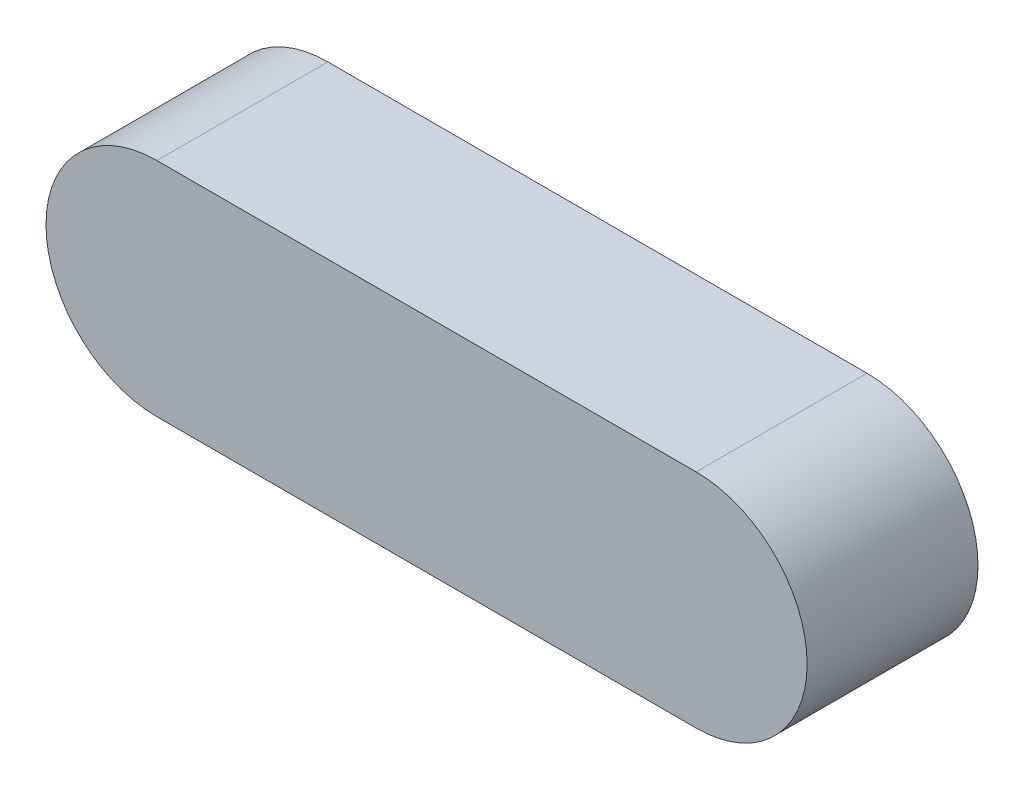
ISO-10303-21;
HEADER;
FILE_DESCRIPTION(('STEP AP214'),'2;1');
FILE_NAME('part.step','',(''),(''),'','','');
FILE_SCHEMA(('AUTOMOTIVE_DESIGN { 1 0 10303 214 1 1 1 1 }'));
ENDSEC;
DATA;
#1=APPLICATION_CONTEXT('core data for automotive mechanical design processes');
#2=APPLICATION_PROTOCOL_DEFINITION('international standard','automotive_design',2000,#1);
#3=PRODUCT_CONTEXT('',#1,'mechanical');
#4=PRODUCT('Part','Part','',(#3));
#5=PRODUCT_RELATED_PRODUCT_CATEGORY('part','',(#4));
#6=PRODUCT_DEFINITION_FORMATION('','',#4);
#7=PRODUCT_DEFINITION_CONTEXT('part definition',#1,'design');
#8=PRODUCT_DEFINITION('design','',#6,#7);
#9=PRODUCT_DEFINITION_SHAPE('','',#8);
#10=(LENGTH_UNIT() NAMED_UNIT(*) SI_UNIT(.MILLI.,.METRE.));
#11=(NAMED_UNIT(*) PLANE_ANGLE_UNIT() SI_UNIT($,.RADIAN.));
#12=(NAMED_UNIT(*) SI_UNIT($,.STERADIAN.) SOLID_ANGLE_UNIT());
#13=UNCERTAINTY_MEASURE_WITH_UNIT(LENGTH_MEASURE(1.E-05),#10,'distance_accuracy_value','');
#14=(GEOMETRIC_REPRESENTATION_CONTEXT(3) GLOBAL_UNCERTAINTY_ASSIGNED_CONTEXT((#13)) GLOBAL_UNIT_ASSIGNED_CONTEXT((#10,
#11,#12)) REPRESENTATION_CONTEXT('',''));
#15=CARTESIAN_POINT('',(0.,0.,0.));
#16=DIRECTION('',(0.,0.,1.));
#17=DIRECTION('',(1.,0.,0.));
#18=AXIS2_PLACEMENT_3D('',#15,#16,#17);
#19=CARTESIAN_POINT('',(-44.45,0.,0.));
#20=DIRECTION('',(0.,0.,1.));
#21=DIRECTION('',(1.,0.,0.));
#22=AXIS2_PLACEMENT_3D('',#19,#20,#21);
#23=PLANE('',#22);
#24=DIRECTION('',(1.,0.,0.));
#25=VECTOR('',#24,1.);
#26=CARTESIAN_POINT('',(0.,-18.288,0.));
#27=LINE('',#26,#25);
#28=CARTESIAN_POINT('',(-88.9,-18.288,0.));
#29=VERTEX_POINT('',#28);
#30=CARTESIAN_POINT('',(0.,-18.288,0.));
#31=VERTEX_POINT('',#30);
#32=EDGE_CURVE('E53',#29,#31,#27,.T.);
#33=ORIENTED_EDGE('',*,*,#32,.F.);
#34=CARTESIAN_POINT('',(-88.9,0.,0.));
#35=DIRECTION('',(0.,0.,1.));
#36=DIRECTION('',(1.,0.,0.));
#37=AXIS2_PLACEMENT_3D('',#34,#35,#36);
#38=CIRCLE('',#37,18.288);
#39=CARTESIAN_POINT('',(-88.9,18.288,0.));
#40=VERTEX_POINT('',#39);
#41=EDGE_CURVE('E68',#40,#29,#38,.T.);
#42=ORIENTED_EDGE('',*,*,#41,.F.);
#43=DIRECTION('',(1.,0.,0.));
#44=VECTOR('',#43,1.);
#45=CARTESIAN_POINT('',(-88.9,18.288,0.));
#46=LINE('',#45,#44);
#47=CARTESIAN_POINT('',(0.,18.288,0.));
#48=VERTEX_POINT('',#47);
#49=EDGE_CURVE('E66',#48,#40,#46,.F.);
#50=ORIENTED_EDGE('',*,*,#49,.F.);
#51=CARTESIAN_POINT('',(0.,0.,0.));
#52=DIRECTION('',(0.,0.,1.));
#53=DIRECTION('',(1.,0.,0.));
#54=AXIS2_PLACEMENT_3D('',#51,#52,#53);
#55=CIRCLE('',#54,18.288);
#56=EDGE_CURVE('E19',#31,#48,#55,.T.);
#57=ORIENTED_EDGE('',*,*,#56,.F.);
#58=EDGE_LOOP('',(#33,#42,#50,#57));
#59=FACE_BOUND('',#58,.T.);
#60=ADVANCED_FACE('F16',(#59),#23,.F.);
#61=CARTESIAN_POINT('',(0.,-18.288,0.));
#62=DIRECTION('',(0.,-1.,0.));
#63=DIRECTION('',(0.,0.,-1.));
#64=AXIS2_PLACEMENT_3D('',#61,#62,#63);
#65=PLANE('',#64);
#66=ORIENTED_EDGE('',*,*,#32,.T.);
#67=DIRECTION('',(0.,0.,1.));
#68=VECTOR('',#67,1.);
#69=CARTESIAN_POINT('',(0.,-18.288,0.));
#70=LINE('',#69,#68);
#71=CARTESIAN_POINT('',(0.,-18.288,28.1686));
#72=VERTEX_POINT('',#71);
#73=EDGE_CURVE('E63',#72,#31,#70,.F.);
#74=ORIENTED_EDGE('',*,*,#73,.F.);
#75=DIRECTION('',(1.,0.,0.));
#76=VECTOR('',#75,1.);
#77=CARTESIAN_POINT('',(-44.45,-18.288,28.1686));
#78=LINE('',#77,#76);
#79=CARTESIAN_POINT('',(-88.9,-18.288,28.1686));
#80=VERTEX_POINT('',#79);
#81=EDGE_CURVE('E80',#80,#72,#78,.T.);
#82=ORIENTED_EDGE('',*,*,#81,.F.);
#83=DIRECTION('',(0.,0.,1.));
#84=VECTOR('',#83,1.);
#85=CARTESIAN_POINT('',(-88.9,-18.288,0.));
#86=LINE('',#85,#84);
#87=EDGE_CURVE('E81',#29,#80,#86,.T.);
#88=ORIENTED_EDGE('',*,*,#87,.F.);
#89=EDGE_LOOP('',(#66,#74,#82,#88));
#90=FACE_BOUND('',#89,.T.);
#91=ADVANCED_FACE('F90',(#90),#65,.T.);
#92=CARTESIAN_POINT('',(0.,0.,0.));
#93=DIRECTION('',(0.,0.,1.));
#94=DIRECTION('',(1.,0.,0.));
#95=AXIS2_PLACEMENT_3D('',#92,#93,#94);
#96=CYLINDRICAL_SURFACE('',#95,18.288);
#97=ORIENTED_EDGE('',*,*,#56,.T.);
#98=DIRECTION('',(0.,0.,1.));
#99=VECTOR('',#98,1.);
#100=CARTESIAN_POINT('',(0.,18.288,0.));
#101=LINE('',#100,#99);
#102=CARTESIAN_POINT('',(0.,18.288,28.1686));
#103=VERTEX_POINT('',#102);
#104=EDGE_CURVE('E62',#103,#48,#101,.F.);
#105=ORIENTED_EDGE('',*,*,#104,.F.);
#106=CARTESIAN_POINT('',(0.,0.,28.1686));
#107=DIRECTION('',(0.,0.,1.));
#108=DIRECTION('',(1.,0.,0.));
#109=AXIS2_PLACEMENT_3D('',#106,#107,#108);
#110=CIRCLE('',#109,18.288);
#111=EDGE_CURVE('E79',#72,#103,#110,.T.);
#112=ORIENTED_EDGE('',*,*,#111,.F.);
#113=ORIENTED_EDGE('',*,*,#73,.T.);
#114=EDGE_LOOP('',(#97,#105,#112,#113));
#115=FACE_BOUND('',#114,.T.);
#116=ADVANCED_FACE('F59',(#115),#96,.T.);
#117=CARTESIAN_POINT('',(-88.9,18.288,0.));
#118=DIRECTION('',(0.,1.,0.));
#119=DIRECTION('',(0.,0.,1.));
#120=AXIS2_PLACEMENT_3D('',#117,#118,#119);
#121=PLANE('',#120);
#122=ORIENTED_EDGE('',*,*,#49,.T.);
#123=DIRECTION('',(0.,0.,1.));
#124=VECTOR('',#123,1.);
#125=CARTESIAN_POINT('',(-88.9,18.288,0.));
#126=LINE('',#125,#124);
#127=CARTESIAN_POINT('',(-88.9,18.288,28.1686));
#128=VERTEX_POINT('',#127);
#129=EDGE_CURVE('E34',#128,#40,#126,.F.);
#130=ORIENTED_EDGE('',*,*,#129,.F.);
#131=DIRECTION('',(1.,0.,0.));
#132=VECTOR('',#131,1.);
#133=CARTESIAN_POINT('',(-44.45,18.288,28.1686));
#134=LINE('',#133,#132);
#135=EDGE_CURVE('E25',#103,#128,#134,.F.);
#136=ORIENTED_EDGE('',*,*,#135,.F.);
#137=ORIENTED_EDGE('',*,*,#104,.T.);
#138=EDGE_LOOP('',(#122,#130,#136,#137));
#139=FACE_BOUND('',#138,.T.);
#140=ADVANCED_FACE('F70',(#139),#121,.T.);
#141=CARTESIAN_POINT('',(-88.9,0.,0.));
#142=DIRECTION('',(0.,0.,1.));
#143=DIRECTION('',(1.,0.,0.));
#144=AXIS2_PLACEMENT_3D('',#141,#142,#143);
#145=CYLINDRICAL_SURFACE('',#144,18.288);
#146=ORIENTED_EDGE('',*,*,#41,.T.);
#147=ORIENTED_EDGE('',*,*,#87,.T.);
#148=CARTESIAN_POINT('',(-88.9,0.,28.1686));
#149=DIRECTION('',(0.,0.,1.));
#150=DIRECTION('',(1.,0.,0.));
#151=AXIS2_PLACEMENT_3D('',#148,#149,#150);
#152=CIRCLE('',#151,18.288);
#153=EDGE_CURVE('E11',#128,#80,#152,.T.);
#154=ORIENTED_EDGE('',*,*,#153,.F.);
#155=ORIENTED_EDGE('',*,*,#129,.T.);
#156=EDGE_LOOP('',(#146,#147,#154,#155));
#157=FACE_BOUND('',#156,.T.);
#158=ADVANCED_FACE('F84',(#157),#145,.T.);
#159=CARTESIAN_POINT('',(-44.45,0.,28.1686));
#160=DIRECTION('',(0.,0.,1.));
#161=DIRECTION('',(1.,0.,0.));
#162=AXIS2_PLACEMENT_3D('',#159,#160,#161);
#163=PLANE('',#162);
#164=ORIENTED_EDGE('',*,*,#135,.T.);
#165=ORIENTED_EDGE('',*,*,#153,.T.);
#166=ORIENTED_EDGE('',*,*,#81,.T.);
#167=ORIENTED_EDGE('',*,*,#111,.T.);
#168=EDGE_LOOP('',(#164,#165,#166,#167));
#169=FACE_BOUND('',#168,.T.);
#170=ADVANCED_FACE('F87',(#169),#163,.T.);
#171=CLOSED_SHELL('',(#60,#91,#116,#140,#158,#170));
#172=MANIFOLD_SOLID_BREP('B1',#171);
#173=ADVANCED_BREP_SHAPE_REPRESENTATION('',(#18,#172),#14);
#174=SHAPE_DEFINITION_REPRESENTATION(#9,#173);
ENDSEC;
END-ISO-10303-21;
